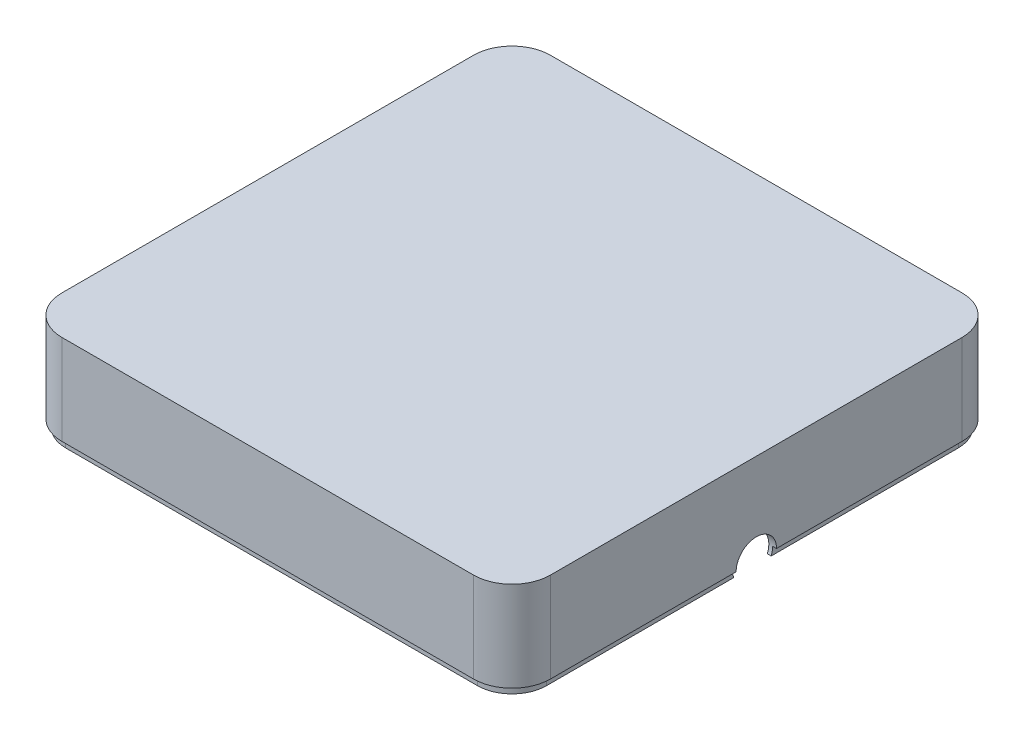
from build123d import *

# Parameters (mm, degrees)
SKETCH1_W           = 127
SKETCH1_H           = 25.4
BOSS_EXTRUDE1_DEPTH = 127
FILLET1_R           = 10
SHELL1_T            = -2
CUT_EXTRUDE1_DEPTH  = 2
SKETCH5_R           = 5.25
CUT_EXTRUDE3_DEPTH  = 4
CUT_EXTRUDE4_REACH  = 183.392
SKETCH6_W           = 15
SKETCH6_H           = 35


with BuildPart() as part:
    # Sketch1 → Boss-Extrude1 (new body)
    with BuildSketch(Plane.XY):
        with Locations((63.5, -12.7)):
            Rectangle(SKETCH1_W, SKETCH1_H)
    extrude(amount=BOSS_EXTRUDE1_DEPTH)

    # Fillet1
    fillet1_edges = [part.edges().sort_by_distance(p)[0] for p in [
        (127, -12.7, 127),
        (0, -12.7, 127),
        (127, -12.7, 0),
        (0, -12.7, 0),
    ]]
    fillet(fillet1_edges, radius=FILLET1_R)

    # Shell1
    shell1_openings = [part.faces().sort_by_distance(p)[0] for p in [
        (63.5, -25.4, 63.5),
    ]]
    offset(amount=SHELL1_T, openings=shell1_openings, kind=Kind.INTERSECTION)

    # Sketch3 → Cut-Extrude1 (cut)
    with BuildSketch(Plane.XZ.offset(25.4)):
        with BuildLine():
            Line((117, 127), (10, 127))
            ThreePointArc((10, 127), (2.928932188, 124.071067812), (0, 117))
            Line((0, 117), (0, 10))
            ThreePointArc((0, 10), (2.928932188, 2.928932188), (10, 0))
            Line((10, 0), (117, 0))
            ThreePointArc((117, 0), (124.071067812, 2.928932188), (127, 10))
            Line((127, 10), (127, 117))
            ThreePointArc((127, 117), (124.071067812, 124.071067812), (117, 127))
        make_face()
        with BuildLine():
            Line((117, 126), (10, 126))
            ThreePointArc((10, 126), (3.636038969, 123.363961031), (1, 117))
            Line((1, 117), (1, 10))
            ThreePointArc((1, 10), (3.636038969, 3.636038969), (10, 1))
            Line((10, 1), (117, 1))
            ThreePointArc((117, 1), (123.363961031, 3.636038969), (126, 10))
            Line((126, 10), (126, 117))
            ThreePointArc((126, 117), (123.363961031, 123.363961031), (117, 126))
        make_face(mode=Mode.SUBTRACT)
    extrude(amount=-CUT_EXTRUDE1_DEPTH, mode=Mode.SUBTRACT)

    # Sketch5 → Cut-Extrude3 (cut)
    with BuildSketch(Plane(origin=(127, 0, 0), x_dir=(0, 0, -1), z_dir=(1, 0, 0))):
        with Locations((-63.5, -23.4)):
            Circle(SKETCH5_R)
    extrude(amount=-CUT_EXTRUDE3_DEPTH, mode=Mode.SUBTRACT)

    # Sketch6 → Cut-Extrude4 (cut, up to next)
    with BuildSketch(Plane(origin=(0, 0, 0), x_dir=(-1, 0, 0), z_dir=(0, 0, -1)), mode=Mode.PRIVATE) as cut_extrude4_sk1:
        with Locations((-30.714826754, -25.107523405)):
            Rectangle(SKETCH6_W, SKETCH6_H)
    cut_extrude4_tool1 = extrude(cut_extrude4_sk1.sketch, amount=-CUT_EXTRUDE4_REACH, mode=Mode.PRIVATE) & part.part
    add(cut_extrude4_tool1.solids().sort_by_distance((30.714827, -25.107523, 0))[0], mode=Mode.SUBTRACT)


solid = part.part
